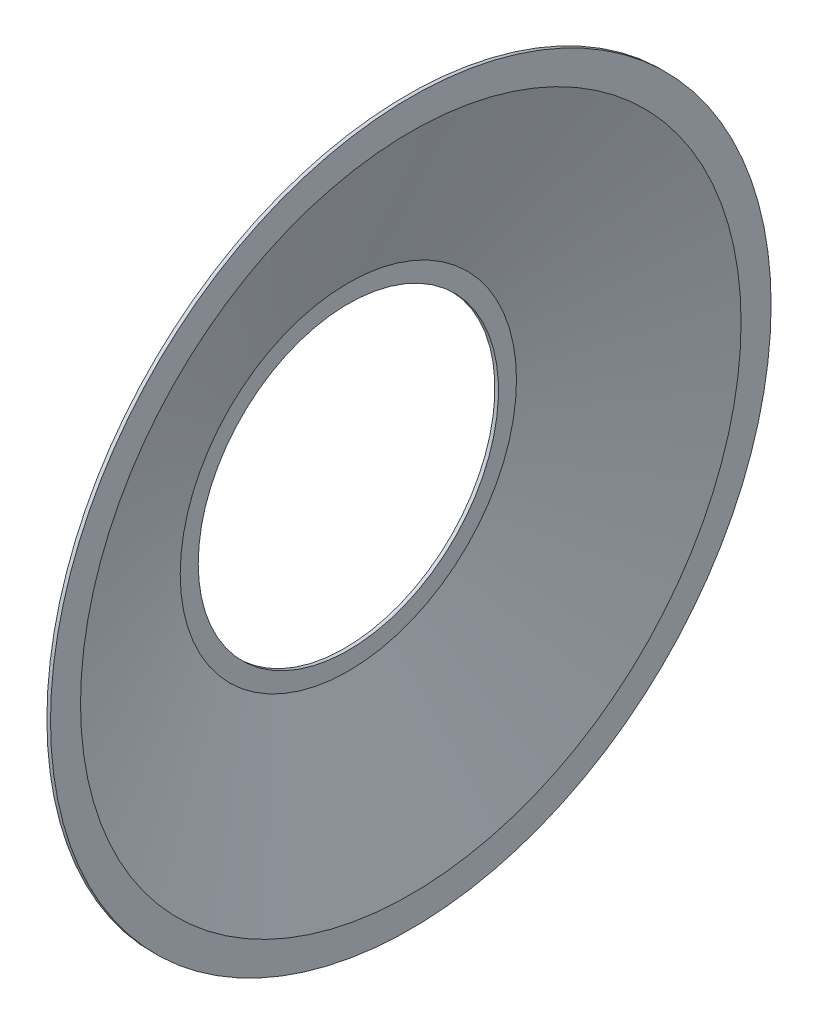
ISO-10303-21;
HEADER;
FILE_DESCRIPTION(('STEP AP214'),'2;1');
FILE_NAME('part.step','',(''),(''),'','','');
FILE_SCHEMA(('AUTOMOTIVE_DESIGN { 1 0 10303 214 1 1 1 1 }'));
ENDSEC;
DATA;
#1=APPLICATION_CONTEXT('core data for automotive mechanical design processes');
#2=APPLICATION_PROTOCOL_DEFINITION('international standard','automotive_design',2000,#1);
#3=PRODUCT_CONTEXT('',#1,'mechanical');
#4=PRODUCT('Part','Part','',(#3));
#5=PRODUCT_RELATED_PRODUCT_CATEGORY('part','',(#4));
#6=PRODUCT_DEFINITION_FORMATION('','',#4);
#7=PRODUCT_DEFINITION_CONTEXT('part definition',#1,'design');
#8=PRODUCT_DEFINITION('design','',#6,#7);
#9=PRODUCT_DEFINITION_SHAPE('','',#8);
#10=(LENGTH_UNIT() NAMED_UNIT(*) SI_UNIT(.MILLI.,.METRE.));
#11=(NAMED_UNIT(*) PLANE_ANGLE_UNIT() SI_UNIT($,.RADIAN.));
#12=(NAMED_UNIT(*) SI_UNIT($,.STERADIAN.) SOLID_ANGLE_UNIT());
#13=UNCERTAINTY_MEASURE_WITH_UNIT(LENGTH_MEASURE(1.E-05),#10,'distance_accuracy_value','');
#14=(GEOMETRIC_REPRESENTATION_CONTEXT(3) GLOBAL_UNCERTAINTY_ASSIGNED_CONTEXT((#13)) GLOBAL_UNIT_ASSIGNED_CONTEXT((#10,
#11,#12)) REPRESENTATION_CONTEXT('',''));
#15=CARTESIAN_POINT('',(0.,0.,0.));
#16=DIRECTION('',(0.,0.,1.));
#17=DIRECTION('',(1.,0.,0.));
#18=AXIS2_PLACEMENT_3D('',#15,#16,#17);
#19=CARTESIAN_POINT('',(0.6,24.9999999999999,0.));
#20=DIRECTION('',(-1.,0.,0.));
#21=DIRECTION('',(0.,0.,1.));
#22=AXIS2_PLACEMENT_3D('',#19,#20,#21);
#23=PLANE('',#22);
#24=CARTESIAN_POINT('',(0.6,0.,0.));
#25=DIRECTION('',(-1.,0.,0.));
#26=DIRECTION('',(0.,0.,1.));
#27=AXIS2_PLACEMENT_3D('',#24,#25,#26);
#28=CIRCLE('',#27,27.9999999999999);
#29=CARTESIAN_POINT('',(0.6,0.,27.9999999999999));
#30=VERTEX_POINT('',#29);
#31=EDGE_CURVE('E70',#30,#30,#28,.T.);
#32=ORIENTED_EDGE('',*,*,#31,.F.);
#33=EDGE_LOOP('',(#32));
#34=FACE_BOUND('',#33,.T.);
#35=CARTESIAN_POINT('',(0.6,0.,0.));
#36=DIRECTION('',(-1.,0.,0.));
#37=DIRECTION('',(0.,0.,1.));
#38=AXIS2_PLACEMENT_3D('',#35,#36,#37);
#39=CIRCLE('',#38,24.9999999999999);
#40=CARTESIAN_POINT('',(0.6,0.,24.9999999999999));
#41=VERTEX_POINT('',#40);
#42=EDGE_CURVE('E12',#41,#41,#39,.T.);
#43=ORIENTED_EDGE('',*,*,#42,.T.);
#44=EDGE_LOOP('',(#43));
#45=FACE_BOUND('',#44,.T.);
#46=ADVANCED_FACE('F42',(#34,#45),#23,.F.);
#47=CARTESIAN_POINT('',(0.,0.,0.));
#48=DIRECTION('',(-1.,0.,0.));
#49=DIRECTION('',(0.,0.,1.));
#50=AXIS2_PLACEMENT_3D('',#47,#48,#49);
#51=CYLINDRICAL_SURFACE('',#50,24.9999999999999);
#52=ORIENTED_EDGE('',*,*,#42,.F.);
#53=EDGE_LOOP('',(#52));
#54=FACE_BOUND('',#53,.T.);
#55=CARTESIAN_POINT('',(0.,0.,0.));
#56=DIRECTION('',(-1.,0.,0.));
#57=DIRECTION('',(0.,0.,1.));
#58=AXIS2_PLACEMENT_3D('',#55,#56,#57);
#59=CIRCLE('',#58,24.9999999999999);
#60=CARTESIAN_POINT('',(0.,0.,24.9999999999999));
#61=VERTEX_POINT('',#60);
#62=EDGE_CURVE('E48',#61,#61,#59,.T.);
#63=ORIENTED_EDGE('',*,*,#62,.T.);
#64=EDGE_LOOP('',(#63));
#65=FACE_BOUND('',#64,.T.);
#66=ADVANCED_FACE('F77',(#54,#65),#51,.F.);
#67=CARTESIAN_POINT('',(0.,24.9999999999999,0.));
#68=DIRECTION('',(1.,0.,0.));
#69=DIRECTION('',(0.,0.,-1.));
#70=AXIS2_PLACEMENT_3D('',#67,#68,#69);
#71=PLANE('',#70);
#72=ORIENTED_EDGE('',*,*,#62,.F.);
#73=EDGE_LOOP('',(#72));
#74=FACE_BOUND('',#73,.T.);
#75=CARTESIAN_POINT('',(0.,0.,0.));
#76=DIRECTION('',(-1.,0.,0.));
#77=DIRECTION('',(0.,0.,1.));
#78=AXIS2_PLACEMENT_3D('',#75,#76,#77);
#79=CIRCLE('',#78,27.9999999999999);
#80=CARTESIAN_POINT('',(0.,0.,27.9999999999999));
#81=VERTEX_POINT('',#80);
#82=EDGE_CURVE('E52',#81,#81,#79,.T.);
#83=ORIENTED_EDGE('',*,*,#82,.T.);
#84=EDGE_LOOP('',(#83));
#85=FACE_BOUND('',#84,.T.);
#86=ADVANCED_FACE('F81',(#74,#85),#71,.F.);
#87=CARTESIAN_POINT('',(10.4,0.,0.));
#88=DIRECTION('',(1.,0.,0.));
#89=DIRECTION('',(0.,0.,-1.));
#90=AXIS2_PLACEMENT_3D('',#87,#88,#89);
#91=CONICAL_SURFACE('',#90,54.9999999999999,1.20312621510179);
#92=ORIENTED_EDGE('',*,*,#82,.F.);
#93=EDGE_LOOP('',(#92));
#94=FACE_BOUND('',#93,.T.);
#95=CARTESIAN_POINT('',(10.4,0.,0.));
#96=DIRECTION('',(-1.,0.,0.));
#97=DIRECTION('',(0.,0.,1.));
#98=AXIS2_PLACEMENT_3D('',#95,#96,#97);
#99=CIRCLE('',#98,54.9999999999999);
#100=CARTESIAN_POINT('',(10.4,0.,54.9999999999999));
#101=VERTEX_POINT('',#100);
#102=EDGE_CURVE('E56',#101,#101,#99,.T.);
#103=ORIENTED_EDGE('',*,*,#102,.T.);
#104=EDGE_LOOP('',(#103));
#105=FACE_BOUND('',#104,.T.);
#106=ADVANCED_FACE('F86',(#94,#105),#91,.T.);
#107=CARTESIAN_POINT('',(10.4,54.9999999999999,0.));
#108=DIRECTION('',(1.,0.,0.));
#109=DIRECTION('',(0.,0.,-1.));
#110=AXIS2_PLACEMENT_3D('',#107,#108,#109);
#111=PLANE('',#110);
#112=ORIENTED_EDGE('',*,*,#102,.F.);
#113=EDGE_LOOP('',(#112));
#114=FACE_BOUND('',#113,.T.);
#115=CARTESIAN_POINT('',(10.4,0.,0.));
#116=DIRECTION('',(-1.,0.,0.));
#117=DIRECTION('',(0.,0.,1.));
#118=AXIS2_PLACEMENT_3D('',#115,#116,#117);
#119=CIRCLE('',#118,59.9999999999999);
#120=CARTESIAN_POINT('',(10.4,0.,59.9999999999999));
#121=VERTEX_POINT('',#120);
#122=EDGE_CURVE('E61',#121,#121,#119,.T.);
#123=ORIENTED_EDGE('',*,*,#122,.T.);
#124=EDGE_LOOP('',(#123));
#125=FACE_BOUND('',#124,.T.);
#126=ADVANCED_FACE('F92',(#114,#125),#111,.F.);
#127=CARTESIAN_POINT('',(0.,0.,0.));
#128=DIRECTION('',(-1.,0.,0.));
#129=DIRECTION('',(0.,0.,1.));
#130=AXIS2_PLACEMENT_3D('',#127,#128,#129);
#131=CYLINDRICAL_SURFACE('',#130,59.9999999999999);
#132=ORIENTED_EDGE('',*,*,#122,.F.);
#133=EDGE_LOOP('',(#132));
#134=FACE_BOUND('',#133,.T.);
#135=CARTESIAN_POINT('',(11.,0.,0.));
#136=DIRECTION('',(-1.,0.,0.));
#137=DIRECTION('',(0.,0.,1.));
#138=AXIS2_PLACEMENT_3D('',#135,#136,#137);
#139=CIRCLE('',#138,59.9999999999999);
#140=CARTESIAN_POINT('',(11.,0.,59.9999999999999));
#141=VERTEX_POINT('',#140);
#142=EDGE_CURVE('E64',#141,#141,#139,.T.);
#143=ORIENTED_EDGE('',*,*,#142,.T.);
#144=EDGE_LOOP('',(#143));
#145=FACE_BOUND('',#144,.T.);
#146=ADVANCED_FACE('F96',(#134,#145),#131,.T.);
#147=CARTESIAN_POINT('',(11.,54.9999999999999,0.));
#148=DIRECTION('',(-1.,0.,0.));
#149=DIRECTION('',(0.,0.,1.));
#150=AXIS2_PLACEMENT_3D('',#147,#148,#149);
#151=PLANE('',#150);
#152=ORIENTED_EDGE('',*,*,#142,.F.);
#153=EDGE_LOOP('',(#152));
#154=FACE_BOUND('',#153,.T.);
#155=CARTESIAN_POINT('',(11.,0.,0.));
#156=DIRECTION('',(-1.,0.,0.));
#157=DIRECTION('',(0.,0.,1.));
#158=AXIS2_PLACEMENT_3D('',#155,#156,#157);
#159=CIRCLE('',#158,54.9999999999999);
#160=CARTESIAN_POINT('',(11.,0.,54.9999999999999));
#161=VERTEX_POINT('',#160);
#162=EDGE_CURVE('E67',#161,#161,#159,.T.);
#163=ORIENTED_EDGE('',*,*,#162,.T.);
#164=EDGE_LOOP('',(#163));
#165=FACE_BOUND('',#164,.T.);
#166=ADVANCED_FACE('F100',(#154,#165),#151,.F.);
#167=CARTESIAN_POINT('',(0.6,0.,0.));
#168=DIRECTION('',(1.,0.,0.));
#169=DIRECTION('',(0.,0.,-1.));
#170=AXIS2_PLACEMENT_3D('',#167,#168,#169);
#171=CONICAL_SURFACE('',#170,27.9999999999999,1.20312621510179);
#172=ORIENTED_EDGE('',*,*,#162,.F.);
#173=EDGE_LOOP('',(#172));
#174=FACE_BOUND('',#173,.T.);
#175=ORIENTED_EDGE('',*,*,#31,.T.);
#176=EDGE_LOOP('',(#175));
#177=FACE_BOUND('',#176,.T.);
#178=ADVANCED_FACE('F74',(#174,#177),#171,.F.);
#179=CLOSED_SHELL('',(#46,#66,#86,#106,#126,#146,#166,#178));
#180=MANIFOLD_SOLID_BREP('B2',#179);
#181=ADVANCED_BREP_SHAPE_REPRESENTATION('',(#18,#180),#14);
#182=SHAPE_DEFINITION_REPRESENTATION(#9,#181);
ENDSEC;
END-ISO-10303-21;
